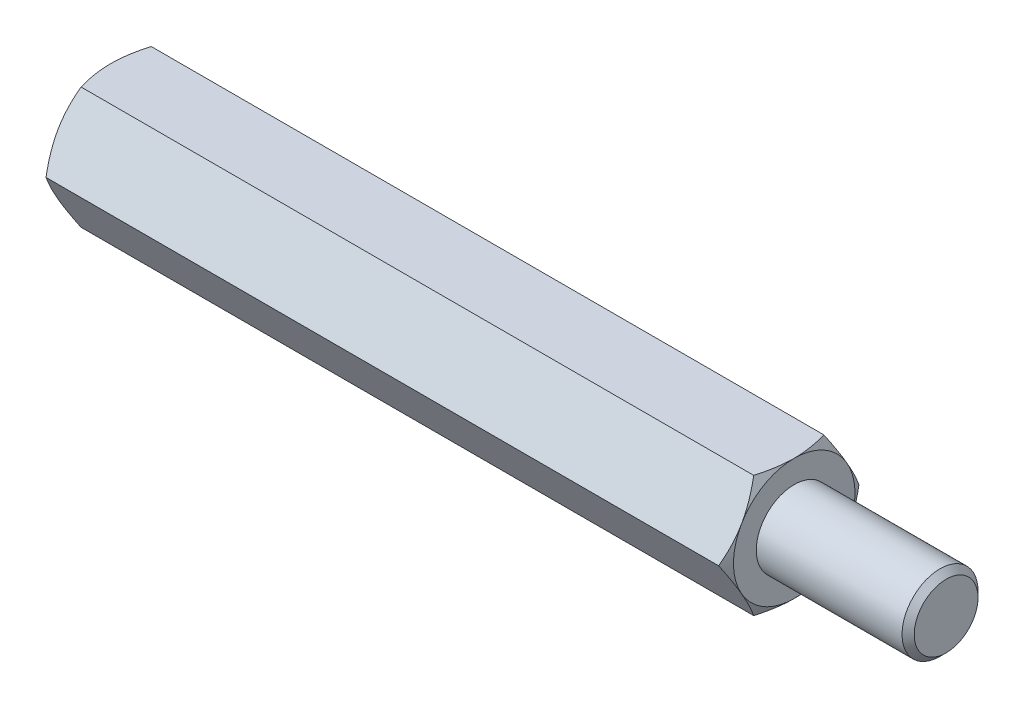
ISO-10303-21;
HEADER;
FILE_DESCRIPTION(('STEP AP214'),'2;1');
FILE_NAME('part.step','',(''),(''),'','','');
FILE_SCHEMA(('AUTOMOTIVE_DESIGN { 1 0 10303 214 1 1 1 1 }'));
ENDSEC;
DATA;
#1=APPLICATION_CONTEXT('core data for automotive mechanical design processes');
#2=APPLICATION_PROTOCOL_DEFINITION('international standard','automotive_design',2000,#1);
#3=PRODUCT_CONTEXT('',#1,'mechanical');
#4=PRODUCT('Part','Part','',(#3));
#5=PRODUCT_RELATED_PRODUCT_CATEGORY('part','',(#4));
#6=PRODUCT_DEFINITION_FORMATION('','',#4);
#7=PRODUCT_DEFINITION_CONTEXT('part definition',#1,'design');
#8=PRODUCT_DEFINITION('design','',#6,#7);
#9=PRODUCT_DEFINITION_SHAPE('','',#8);
#10=(LENGTH_UNIT() NAMED_UNIT(*) SI_UNIT(.MILLI.,.METRE.));
#11=(NAMED_UNIT(*) PLANE_ANGLE_UNIT() SI_UNIT($,.RADIAN.));
#12=(NAMED_UNIT(*) SI_UNIT($,.STERADIAN.) SOLID_ANGLE_UNIT());
#13=UNCERTAINTY_MEASURE_WITH_UNIT(LENGTH_MEASURE(1.E-05),#10,'distance_accuracy_value','');
#14=(GEOMETRIC_REPRESENTATION_CONTEXT(3) GLOBAL_UNCERTAINTY_ASSIGNED_CONTEXT((#13)) GLOBAL_UNIT_ASSIGNED_CONTEXT((#10,
#11,#12)) REPRESENTATION_CONTEXT('',''));
#15=CARTESIAN_POINT('',(0.,0.,0.));
#16=DIRECTION('',(0.,0.,1.));
#17=DIRECTION('',(1.,0.,0.));
#18=AXIS2_PLACEMENT_3D('',#15,#16,#17);
#19=CARTESIAN_POINT('',(22.5,4.,-2.3094010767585));
#20=DIRECTION('',(1.,0.,0.));
#21=DIRECTION('',(0.,0.,-1.));
#22=AXIS2_PLACEMENT_3D('',#19,#20,#21);
#23=PLANE('',#22);
#24=CARTESIAN_POINT('',(22.5,0.,0.));
#25=DIRECTION('',(1.,0.,0.));
#26=DIRECTION('',(0.,0.,-1.));
#27=AXIS2_PLACEMENT_3D('',#24,#25,#26);
#28=CIRCLE('',#27,4.);
#29=CARTESIAN_POINT('',(22.5,-2.,-3.46410161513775));
#30=VERTEX_POINT('',#29);
#31=CARTESIAN_POINT('',(22.5,2.,-3.46410161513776));
#32=VERTEX_POINT('',#31);
#33=EDGE_CURVE('E288',#30,#32,#28,.T.);
#34=ORIENTED_EDGE('',*,*,#33,.T.);
#35=CARTESIAN_POINT('',(22.5,4.,0.));
#36=VERTEX_POINT('',#35);
#37=EDGE_CURVE('E53',#32,#36,#28,.T.);
#38=ORIENTED_EDGE('',*,*,#37,.T.);
#39=CARTESIAN_POINT('',(22.5,2.,3.46410161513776));
#40=VERTEX_POINT('',#39);
#41=EDGE_CURVE('E297',#36,#40,#28,.T.);
#42=ORIENTED_EDGE('',*,*,#41,.T.);
#43=CARTESIAN_POINT('',(22.5,-2.00000000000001,3.46410161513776));
#44=VERTEX_POINT('',#43);
#45=EDGE_CURVE('E301',#40,#44,#28,.T.);
#46=ORIENTED_EDGE('',*,*,#45,.T.);
#47=CARTESIAN_POINT('',(22.5,0.,0.));
#48=DIRECTION('',(-1.,0.,0.));
#49=DIRECTION('',(0.,-1.,0.));
#50=AXIS2_PLACEMENT_3D('',#47,#48,#49);
#51=CIRCLE('',#50,4.);
#52=CARTESIAN_POINT('',(22.5,-4.00000000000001,0.));
#53=VERTEX_POINT('',#52);
#54=EDGE_CURVE('E193',#53,#44,#51,.T.);
#55=ORIENTED_EDGE('',*,*,#54,.F.);
#56=EDGE_CURVE('E61',#53,#30,#28,.T.);
#57=ORIENTED_EDGE('',*,*,#56,.T.);
#58=EDGE_LOOP('',(#34,#38,#42,#46,#55,#57));
#59=FACE_BOUND('',#58,.T.);
#60=CARTESIAN_POINT('',(22.5,0.,0.));
#61=DIRECTION('',(1.,0.,0.));
#62=DIRECTION('',(0.,0.,-1.));
#63=AXIS2_PLACEMENT_3D('',#60,#61,#62);
#64=CIRCLE('',#63,2.5);
#65=CARTESIAN_POINT('',(22.5,0.,-2.5));
#66=VERTEX_POINT('',#65);
#67=EDGE_CURVE('E322',#66,#66,#64,.T.);
#68=ORIENTED_EDGE('',*,*,#67,.F.);
#69=EDGE_LOOP('',(#68));
#70=FACE_BOUND('',#69,.T.);
#71=ADVANCED_FACE('F37',(#59,#70),#23,.T.);
#72=CARTESIAN_POINT('',(22.5,0.,-4.61880215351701));
#73=DIRECTION('',(0.,-0.5,0.866025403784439));
#74=DIRECTION('',(0.,-0.866025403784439,-0.5));
#75=AXIS2_PLACEMENT_3D('',#72,#73,#74);
#76=PLANE('',#75);
#77=CARTESIAN_POINT('',(22.1426677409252,-0.000200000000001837,-4.61891762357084));
#78=CARTESIAN_POINT('',(22.2012821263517,0.175579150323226,-4.51743148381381));
#79=CARTESIAN_POINT('',(22.2545896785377,0.352875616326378,-4.41506932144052));
#80=CARTESIAN_POINT('',(22.3476383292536,0.710538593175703,-4.2085725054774));
#81=CARTESIAN_POINT('',(22.3873465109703,0.890911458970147,-4.10443418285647));
#82=CARTESIAN_POINT('',(22.4491577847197,1.24942181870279,-3.89744813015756));
#83=CARTESIAN_POINT('',(22.4716722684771,1.42750415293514,-3.79463224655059));
#84=CARTESIAN_POINT('',(22.4985493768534,1.7845067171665,-3.58851671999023));
#85=CARTESIAN_POINT('',(22.5029342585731,1.9634256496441,-3.48521782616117));
#86=CARTESIAN_POINT('',(22.49380992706,2.29774284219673,-3.29219970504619));
#87=CARTESIAN_POINT('',(22.482541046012,2.45319115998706,-3.20245157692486));
#88=CARTESIAN_POINT('',(22.4468260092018,2.76307505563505,-3.02354002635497));
#89=CARTESIAN_POINT('',(22.4223676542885,2.91750956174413,-2.93437722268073));
#90=CARTESIAN_POINT('',(22.3612239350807,3.22803232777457,-2.75509682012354));
#91=CARTESIAN_POINT('',(22.3242793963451,3.3840812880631,-2.6650019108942));
#92=CARTESIAN_POINT('',(22.240429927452,3.69385183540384,-2.48615580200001));
#93=CARTESIAN_POINT('',(22.1935446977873,3.84757739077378,-2.39740231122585));
#94=CARTESIAN_POINT('',(22.1426677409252,4.0002,-2.30928560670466));
#95=B_SPLINE_CURVE_WITH_KNOTS('',3,(#77,#78,#79,#80,#81,#82,#83,#84,#85,#86,#87,#88,#89,#90,#91,
#92,#93,#94),.UNSPECIFIED.,.F.,.F.,(4,2,2,2,2,2,2,2,4),(0.,0.634047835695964,1.26961969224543,
1.88946157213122,2.50854226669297,3.04757825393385,3.58711366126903,4.13861653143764,
4.68903648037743),.UNSPECIFIED.);
#96=CARTESIAN_POINT('',(22.1427344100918,0.,-4.61880215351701));
#97=VERTEX_POINT('',#96);
#98=EDGE_CURVE('E330',#97,#32,#95,.T.);
#99=ORIENTED_EDGE('',*,*,#98,.F.);
#100=DIRECTION('',(-1.,0.,0.));
#101=VECTOR('',#100,1.);
#102=CARTESIAN_POINT('',(22.5,0.,-4.61880215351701));
#103=LINE('',#102,#101);
#104=CARTESIAN_POINT('',(-22.1427344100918,0.,-4.61880215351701));
#105=VERTEX_POINT('',#104);
#106=EDGE_CURVE('E264',#97,#105,#103,.T.);
#107=ORIENTED_EDGE('',*,*,#106,.T.);
#108=CARTESIAN_POINT('',(-22.1426677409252,4.0002,-2.30928560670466));
#109=CARTESIAN_POINT('',(-22.2012821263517,3.82442084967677,-2.4107717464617));
#110=CARTESIAN_POINT('',(-22.2545896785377,3.64712438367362,-2.51313390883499));
#111=CARTESIAN_POINT('',(-22.3476383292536,3.28946140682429,-2.71963072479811));
#112=CARTESIAN_POINT('',(-22.3873465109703,3.10908854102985,-2.82376904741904));
#113=CARTESIAN_POINT('',(-22.4491577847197,2.75057818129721,-3.03075510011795));
#114=CARTESIAN_POINT('',(-22.4716722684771,2.57249584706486,-3.13357098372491));
#115=CARTESIAN_POINT('',(-22.4985493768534,2.21549328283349,-3.33968651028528));
#116=CARTESIAN_POINT('',(-22.5029342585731,2.0365743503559,-3.44298540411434));
#117=CARTESIAN_POINT('',(-22.49380992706,1.70225715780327,-3.63600352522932));
#118=CARTESIAN_POINT('',(-22.482541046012,1.54680884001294,-3.72575165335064));
#119=CARTESIAN_POINT('',(-22.4468260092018,1.23692494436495,-3.90466320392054));
#120=CARTESIAN_POINT('',(-22.4223676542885,1.08249043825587,-3.99382600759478));
#121=CARTESIAN_POINT('',(-22.3612239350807,0.771967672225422,-4.17310641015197));
#122=CARTESIAN_POINT('',(-22.3242793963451,0.615918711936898,-4.26320131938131));
#123=CARTESIAN_POINT('',(-22.240429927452,0.30614816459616,-4.4420474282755));
#124=CARTESIAN_POINT('',(-22.1935446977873,0.15242260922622,-4.53080091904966));
#125=CARTESIAN_POINT('',(-22.1426677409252,-0.000200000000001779,-4.61891762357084));
#126=B_SPLINE_CURVE_WITH_KNOTS('',3,(#108,#109,#110,#111,#112,#113,#114,#115,#116,#117,#118,
#119,#120,#121,#122,#123,#124,#125),.UNSPECIFIED.,.F.,.F.,(4,2,2,2,2,2,2,2,4),(0.,
0.634047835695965,1.26961969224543,1.88946157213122,2.50854226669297,3.04757825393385,
3.58711366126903,4.13861653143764,4.68903648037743),.UNSPECIFIED.);
#127=CARTESIAN_POINT('',(-22.5,2.,-3.46410161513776));
#128=VERTEX_POINT('',#127);
#129=EDGE_CURVE('E335',#128,#105,#126,.T.);
#130=ORIENTED_EDGE('',*,*,#129,.F.);
#131=CARTESIAN_POINT('',(-22.1427344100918,4.,-2.3094010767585));
#132=VERTEX_POINT('',#131);
#133=EDGE_CURVE('E332',#132,#128,#126,.T.);
#134=ORIENTED_EDGE('',*,*,#133,.F.);
#135=DIRECTION('',(-1.,0.,0.));
#136=VECTOR('',#135,1.);
#137=CARTESIAN_POINT('',(22.5,4.,-2.3094010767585));
#138=LINE('',#137,#136);
#139=CARTESIAN_POINT('',(22.142734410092,4.,-2.30940107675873));
#140=VERTEX_POINT('',#139);
#141=EDGE_CURVE('E279',#140,#132,#138,.T.);
#142=ORIENTED_EDGE('',*,*,#141,.F.);
#143=EDGE_CURVE('E229',#32,#140,#95,.T.);
#144=ORIENTED_EDGE('',*,*,#143,.F.);
#145=EDGE_LOOP('',(#99,#107,#130,#134,#142,#144));
#146=FACE_BOUND('',#145,.T.);
#147=ADVANCED_FACE('F148',(#146),#76,.F.);
#148=CARTESIAN_POINT('',(22.5,4.,-2.3094010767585));
#149=DIRECTION('',(0.,-1.,0.));
#150=DIRECTION('',(0.,0.,-1.));
#151=AXIS2_PLACEMENT_3D('',#148,#149,#150);
#152=PLANE('',#151);
#153=CARTESIAN_POINT('',(20.5082907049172,4.,-6.28479524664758));
#154=CARTESIAN_POINT('',(20.5937006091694,4.,-6.10939349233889));
#155=CARTESIAN_POINT('',(20.6783148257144,4.,-5.93359774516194));
#156=CARTESIAN_POINT('',(20.8455059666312,4.,-5.58100905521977));
#157=CARTESIAN_POINT('',(20.9280825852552,4.,-5.40421596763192));
#158=CARTESIAN_POINT('',(21.0911508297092,4.,-5.04855089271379));
#159=CARTESIAN_POINT('',(21.1716293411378,4.,-4.86967287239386));
#160=CARTESIAN_POINT('',(21.329400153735,4.,-4.51052237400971));
#161=CARTESIAN_POINT('',(21.406692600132,4.,-4.33024995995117));
#162=CARTESIAN_POINT('',(21.559802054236,4.,-3.96189114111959));
#163=CARTESIAN_POINT('',(21.635480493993,4.,-3.77374683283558));
#164=CARTESIAN_POINT('',(21.7813045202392,4.,-3.39528725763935));
#165=CARTESIAN_POINT('',(21.8514494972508,4.,-3.2049717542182));
#166=CARTESIAN_POINT('',(21.9844245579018,4.,-2.82219775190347));
#167=CARTESIAN_POINT('',(22.0472687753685,4.,-2.62974421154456));
#168=CARTESIAN_POINT('',(22.1636796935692,4.,-2.24207725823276));
#169=CARTESIAN_POINT('',(22.2172492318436,4.,-2.04686470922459));
#170=CARTESIAN_POINT('',(22.3123031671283,4.,-1.65467425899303));
#171=CARTESIAN_POINT('',(22.3538563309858,4.,-1.45771333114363));
#172=CARTESIAN_POINT('',(22.4225903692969,4.,-1.06125849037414));
#173=CARTESIAN_POINT('',(22.4497727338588,4.,-0.861764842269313));
#174=CARTESIAN_POINT('',(22.4872447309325,4.,-0.463879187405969));
#175=CARTESIAN_POINT('',(22.4977578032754,4.,-0.265508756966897));
#176=CARTESIAN_POINT('',(22.5015934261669,4.,0.131417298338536));
#177=CARTESIAN_POINT('',(22.4949158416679,4.,0.329972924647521));
#178=CARTESIAN_POINT('',(22.4696489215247,4.,0.664692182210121));
#179=CARTESIAN_POINT('',(22.4553708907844,4.,0.801202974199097));
#180=CARTESIAN_POINT('',(22.4195349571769,4.,1.07327201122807));
#181=CARTESIAN_POINT('',(22.3979761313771,4.,1.20883013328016));
#182=CARTESIAN_POINT('',(22.3235066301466,4.,1.61386939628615));
#183=CARTESIAN_POINT('',(22.2608149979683,4.,1.88157484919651));
#184=CARTESIAN_POINT('',(22.1515117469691,4.,2.28197262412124));
#185=CARTESIAN_POINT('',(22.112009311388,4.,2.41672443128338));
#186=CARTESIAN_POINT('',(22.0287523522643,4.,2.68492067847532));
#187=CARTESIAN_POINT('',(21.9849977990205,4.,2.81836510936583));
#188=CARTESIAN_POINT('',(21.8939510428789,4.,3.08398596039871));
#189=CARTESIAN_POINT('',(21.846659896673,4.,3.21616274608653));
#190=CARTESIAN_POINT('',(21.7491111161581,4.,3.47941134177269));
#191=CARTESIAN_POINT('',(21.6988535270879,4.,3.61048316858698));
#192=CARTESIAN_POINT('',(21.5713295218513,4.,3.93385125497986));
#193=CARTESIAN_POINT('',(21.4926014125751,4.,4.12557021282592));
#194=CARTESIAN_POINT('',(21.3309693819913,4.,4.50724553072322));
#195=CARTESIAN_POINT('',(21.2480651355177,4.,4.69720175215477));
#196=CARTESIAN_POINT('',(21.0789699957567,4.,5.07569950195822));
#197=CARTESIAN_POINT('',(20.9927782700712,4.,5.26424065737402));
#198=CARTESIAN_POINT('',(20.8178011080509,4.,5.64011758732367));
#199=CARTESIAN_POINT('',(20.7290156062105,4.,5.82745333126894));
#200=CARTESIAN_POINT('',(20.4593432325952,4.,6.38844423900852));
#201=CARTESIAN_POINT('',(20.2753561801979,4.,6.76060781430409));
#202=CARTESIAN_POINT('',(19.9019562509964,4.,7.50211228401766));
#203=CARTESIAN_POINT('',(19.7125442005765,4.,7.87145359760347));
#204=CARTESIAN_POINT('',(19.3473877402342,4.,8.57450173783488));
#205=CARTESIAN_POINT('',(19.171975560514,4.,8.90838144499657));
#206=CARTESIAN_POINT('',(18.8188097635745,4.,9.57491712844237));
#207=CARTESIAN_POINT('',(18.6410560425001,4.,9.90757304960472));
#208=CARTESIAN_POINT('',(18.2842933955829,4.,10.5709822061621));
#209=CARTESIAN_POINT('',(18.1052895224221,3.99999999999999,10.9017381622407));
#210=CARTESIAN_POINT('',(17.7459071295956,3.99999999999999,11.5624752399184));
#211=CARTESIAN_POINT('',(17.5655286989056,3.99999999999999,11.8924564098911));
#212=CARTESIAN_POINT('',(17.384642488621,3.99999999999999,12.2221569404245));
#213=B_SPLINE_CURVE_WITH_KNOTS('',3,(#153,#154,#155,#156,#157,#158,#159,#160,#161,#162,#163,
#164,#165,#166,#167,#168,#169,#170,#171,#172,#173,#174,#175,#176,#177,#178,#179,#180,#181,#182,
#183,#184,#185,#186,#187,#188,#189,#190,#191,#192,#193,#194,#195,#196,#197,#198,#199,#200,#201,
#202,#203,#204,#205,#206,#207,#208,#209,#210,#211,#212),.UNSPECIFIED.,.F.,.F.,(4,2,2,2,2,2,2,2,
2,2,2,2,2,2,2,2,2,2,2,2,2,2,2,2,2,2,2,2,2,4),(0.,0.58528075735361,1.17064881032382,
1.75906864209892,2.34746162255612,2.95577704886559,3.56415938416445,4.17134357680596,
4.77834167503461,5.38179402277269,5.98518378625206,6.58041501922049,7.17565092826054,
7.5872191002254,7.99883946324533,8.82250155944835,9.24373134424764,9.66496407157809,
10.086071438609,10.5071723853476,11.1288656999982,11.7506074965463,12.3725077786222,
12.9944237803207,14.2398211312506,15.4850297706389,16.6164791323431,17.7479788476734,
18.8762380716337,20.0044248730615),.UNSPECIFIED.);
#214=EDGE_CURVE('E227',#140,#36,#213,.T.);
#215=ORIENTED_EDGE('',*,*,#214,.F.);
#216=ORIENTED_EDGE('',*,*,#141,.T.);
#217=CARTESIAN_POINT('',(-20.5082907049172,4.,-6.28479524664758));
#218=CARTESIAN_POINT('',(-20.5937006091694,4.,-6.10939349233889));
#219=CARTESIAN_POINT('',(-20.6783148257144,4.,-5.93359774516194));
#220=CARTESIAN_POINT('',(-20.8455059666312,4.,-5.58100905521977));
#221=CARTESIAN_POINT('',(-20.9280825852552,4.,-5.40421596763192));
#222=CARTESIAN_POINT('',(-21.0911508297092,4.,-5.04855089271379));
#223=CARTESIAN_POINT('',(-21.1716293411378,4.,-4.86967287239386));
#224=CARTESIAN_POINT('',(-21.329400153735,4.,-4.51052237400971));
#225=CARTESIAN_POINT('',(-21.406692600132,4.,-4.33024995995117));
#226=CARTESIAN_POINT('',(-21.559802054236,4.,-3.96189114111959));
#227=CARTESIAN_POINT('',(-21.635480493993,4.,-3.77374683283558));
#228=CARTESIAN_POINT('',(-21.7813045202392,4.,-3.39528725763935));
#229=CARTESIAN_POINT('',(-21.8514494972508,4.,-3.2049717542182));
#230=CARTESIAN_POINT('',(-21.9844245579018,4.,-2.82219775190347));
#231=CARTESIAN_POINT('',(-22.0472687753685,4.,-2.62974421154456));
#232=CARTESIAN_POINT('',(-22.1636796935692,4.,-2.24207725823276));
#233=CARTESIAN_POINT('',(-22.2172492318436,4.,-2.04686470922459));
#234=CARTESIAN_POINT('',(-22.3123031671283,4.,-1.65467425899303));
#235=CARTESIAN_POINT('',(-22.3538563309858,4.,-1.45771333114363));
#236=CARTESIAN_POINT('',(-22.4225903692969,4.,-1.06125849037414));
#237=CARTESIAN_POINT('',(-22.4497727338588,4.,-0.861764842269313));
#238=CARTESIAN_POINT('',(-22.4872447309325,4.,-0.463879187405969));
#239=CARTESIAN_POINT('',(-22.4977578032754,4.,-0.265508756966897));
#240=CARTESIAN_POINT('',(-22.5015934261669,4.,0.131417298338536));
#241=CARTESIAN_POINT('',(-22.4949158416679,4.,0.329972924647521));
#242=CARTESIAN_POINT('',(-22.4696489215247,4.,0.664692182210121));
#243=CARTESIAN_POINT('',(-22.4553708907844,4.,0.801202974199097));
#244=CARTESIAN_POINT('',(-22.4195349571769,4.,1.07327201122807));
#245=CARTESIAN_POINT('',(-22.3979761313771,4.,1.20883013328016));
#246=CARTESIAN_POINT('',(-22.3235066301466,4.,1.61386939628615));
#247=CARTESIAN_POINT('',(-22.2608149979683,4.,1.88157484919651));
#248=CARTESIAN_POINT('',(-22.1515117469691,4.,2.28197262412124));
#249=CARTESIAN_POINT('',(-22.112009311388,4.,2.41672443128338));
#250=CARTESIAN_POINT('',(-22.0287523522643,4.,2.68492067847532));
#251=CARTESIAN_POINT('',(-21.9849977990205,4.,2.81836510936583));
#252=CARTESIAN_POINT('',(-21.8939510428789,4.,3.08398596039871));
#253=CARTESIAN_POINT('',(-21.846659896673,4.,3.21616274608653));
#254=CARTESIAN_POINT('',(-21.7491111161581,4.,3.47941134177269));
#255=CARTESIAN_POINT('',(-21.6988535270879,4.,3.61048316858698));
#256=CARTESIAN_POINT('',(-21.5713295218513,4.,3.93385125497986));
#257=CARTESIAN_POINT('',(-21.4926014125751,4.,4.12557021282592));
#258=CARTESIAN_POINT('',(-21.3309693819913,4.,4.50724553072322));
#259=CARTESIAN_POINT('',(-21.2480651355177,4.,4.69720175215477));
#260=CARTESIAN_POINT('',(-21.0789699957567,4.,5.07569950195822));
#261=CARTESIAN_POINT('',(-20.9927782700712,4.,5.26424065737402));
#262=CARTESIAN_POINT('',(-20.8178011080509,4.,5.64011758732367));
#263=CARTESIAN_POINT('',(-20.7290156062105,4.,5.82745333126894));
#264=CARTESIAN_POINT('',(-20.4593432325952,4.,6.38844423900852));
#265=CARTESIAN_POINT('',(-20.2753561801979,4.,6.76060781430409));
#266=CARTESIAN_POINT('',(-19.9019562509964,4.,7.50211228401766));
#267=CARTESIAN_POINT('',(-19.7125442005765,4.,7.87145359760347));
#268=CARTESIAN_POINT('',(-19.3473877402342,4.,8.57450173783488));
#269=CARTESIAN_POINT('',(-19.171975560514,4.,8.90838144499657));
#270=CARTESIAN_POINT('',(-18.8188097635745,4.,9.57491712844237));
#271=CARTESIAN_POINT('',(-18.6410560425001,4.,9.90757304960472));
#272=CARTESIAN_POINT('',(-18.2842933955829,4.,10.5709822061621));
#273=CARTESIAN_POINT('',(-18.1052895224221,3.99999999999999,10.9017381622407));
#274=CARTESIAN_POINT('',(-17.7459071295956,3.99999999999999,11.5624752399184));
#275=CARTESIAN_POINT('',(-17.5655286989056,3.99999999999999,11.8924564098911));
#276=CARTESIAN_POINT('',(-17.384642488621,3.99999999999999,12.2221569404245));
#277=B_SPLINE_CURVE_WITH_KNOTS('',3,(#217,#218,#219,#220,#221,#222,#223,#224,#225,#226,#227,
#228,#229,#230,#231,#232,#233,#234,#235,#236,#237,#238,#239,#240,#241,#242,#243,#244,#245,#246,
#247,#248,#249,#250,#251,#252,#253,#254,#255,#256,#257,#258,#259,#260,#261,#262,#263,#264,#265,
#266,#267,#268,#269,#270,#271,#272,#273,#274,#275,#276),.UNSPECIFIED.,.F.,.F.,(4,2,2,2,2,2,2,2,
2,2,2,2,2,2,2,2,2,2,2,2,2,2,2,2,2,2,2,2,2,4),(0.,0.58528075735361,1.17064881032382,
1.75906864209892,2.34746162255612,2.95577704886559,3.56415938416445,4.17134357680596,
4.77834167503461,5.38179402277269,5.98518378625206,6.58041501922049,7.17565092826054,
7.5872191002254,7.99883946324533,8.82250155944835,9.24373134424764,9.66496407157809,
10.086071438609,10.5071723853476,11.1288656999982,11.7506074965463,12.3725077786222,
12.9944237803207,14.2398211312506,15.4850297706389,16.6164791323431,17.7479788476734,
18.8762380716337,20.0044248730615),.UNSPECIFIED.);
#278=CARTESIAN_POINT('',(-22.5,4.,0.));
#279=VERTEX_POINT('',#278);
#280=EDGE_CURVE('E241',#279,#132,#277,.F.);
#281=ORIENTED_EDGE('',*,*,#280,.F.);
#282=CARTESIAN_POINT('',(-22.1427344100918,4.,2.3094010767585));
#283=VERTEX_POINT('',#282);
#284=EDGE_CURVE('E249',#283,#279,#277,.F.);
#285=ORIENTED_EDGE('',*,*,#284,.F.);
#286=DIRECTION('',(-1.,0.,0.));
#287=VECTOR('',#286,1.);
#288=CARTESIAN_POINT('',(22.5,4.,2.3094010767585));
#289=LINE('',#288,#287);
#290=CARTESIAN_POINT('',(22.1427344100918,4.,2.3094010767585));
#291=VERTEX_POINT('',#290);
#292=EDGE_CURVE('E276',#291,#283,#289,.T.);
#293=ORIENTED_EDGE('',*,*,#292,.F.);
#294=EDGE_CURVE('E221',#36,#291,#213,.T.);
#295=ORIENTED_EDGE('',*,*,#294,.F.);
#296=EDGE_LOOP('',(#215,#216,#281,#285,#293,#295));
#297=FACE_BOUND('',#296,.T.);
#298=ADVANCED_FACE('F153',(#297),#152,.F.);
#299=CARTESIAN_POINT('',(22.5,4.,2.3094010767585));
#300=DIRECTION('',(0.,-0.5,-0.866025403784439));
#301=DIRECTION('',(0.,0.866025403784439,-0.5));
#302=AXIS2_PLACEMENT_3D('',#299,#300,#301);
#303=PLANE('',#302);
#304=CARTESIAN_POINT('',(22.1426677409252,4.0002,2.30928560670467));
#305=CARTESIAN_POINT('',(22.2012821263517,3.82442084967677,2.4107717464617));
#306=CARTESIAN_POINT('',(22.2545896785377,3.64712438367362,2.51313390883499));
#307=CARTESIAN_POINT('',(22.3476383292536,3.28946140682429,2.71963072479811));
#308=CARTESIAN_POINT('',(22.3873465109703,3.10908854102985,2.82376904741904));
#309=CARTESIAN_POINT('',(22.4491577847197,2.75057818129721,3.03075510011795));
#310=CARTESIAN_POINT('',(22.4716722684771,2.57249584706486,3.13357098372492));
#311=CARTESIAN_POINT('',(22.4985493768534,2.21549328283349,3.33968651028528));
#312=CARTESIAN_POINT('',(22.5029342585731,2.0365743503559,3.44298540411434));
#313=CARTESIAN_POINT('',(22.49380992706,1.70225715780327,3.63600352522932));
#314=CARTESIAN_POINT('',(22.482541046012,1.54680884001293,3.72575165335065));
#315=CARTESIAN_POINT('',(22.4468260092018,1.23692494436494,3.90466320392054));
#316=CARTESIAN_POINT('',(22.4223676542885,1.08249043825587,3.99382600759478));
#317=CARTESIAN_POINT('',(22.3612239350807,0.771967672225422,4.17310641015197));
#318=CARTESIAN_POINT('',(22.3242793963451,0.615918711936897,4.26320131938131));
#319=CARTESIAN_POINT('',(22.240429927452,0.30614816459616,4.4420474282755));
#320=CARTESIAN_POINT('',(22.1935446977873,0.152422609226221,4.53080091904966));
#321=CARTESIAN_POINT('',(22.1426677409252,-0.000199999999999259,4.61891762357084));
#322=B_SPLINE_CURVE_WITH_KNOTS('',3,(#304,#305,#306,#307,#308,#309,#310,#311,#312,#313,#314,
#315,#316,#317,#318,#319,#320,#321),.UNSPECIFIED.,.F.,.F.,(4,2,2,2,2,2,2,2,4),(0.,
0.634047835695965,1.26961969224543,1.88946157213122,2.50854226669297,3.04757825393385,
3.58711366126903,4.13861653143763,4.68903648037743),.UNSPECIFIED.);
#323=EDGE_CURVE('E228',#291,#40,#322,.T.);
#324=ORIENTED_EDGE('',*,*,#323,.F.);
#325=ORIENTED_EDGE('',*,*,#292,.T.);
#326=CARTESIAN_POINT('',(-22.1426677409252,-0.000199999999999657,4.61891762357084));
#327=CARTESIAN_POINT('',(-22.2012821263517,0.175579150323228,4.5174314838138));
#328=CARTESIAN_POINT('',(-22.2545896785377,0.352875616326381,4.41506932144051));
#329=CARTESIAN_POINT('',(-22.3476383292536,0.710538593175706,4.20857250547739));
#330=CARTESIAN_POINT('',(-22.3873465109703,0.89091145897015,4.10443418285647));
#331=CARTESIAN_POINT('',(-22.4491577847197,1.24942181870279,3.89744813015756));
#332=CARTESIAN_POINT('',(-22.4716722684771,1.42750415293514,3.79463224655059));
#333=CARTESIAN_POINT('',(-22.4985493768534,1.78450671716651,3.58851671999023));
#334=CARTESIAN_POINT('',(-22.5029342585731,1.9634256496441,3.48521782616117));
#335=CARTESIAN_POINT('',(-22.49380992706,2.29774284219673,3.29219970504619));
#336=CARTESIAN_POINT('',(-22.482541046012,2.45319115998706,3.20245157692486));
#337=CARTESIAN_POINT('',(-22.4468260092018,2.76307505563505,3.02354002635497));
#338=CARTESIAN_POINT('',(-22.4223676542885,2.91750956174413,2.93437722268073));
#339=CARTESIAN_POINT('',(-22.3612239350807,3.22803232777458,2.75509682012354));
#340=CARTESIAN_POINT('',(-22.3242793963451,3.3840812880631,2.6650019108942));
#341=CARTESIAN_POINT('',(-22.240429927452,3.69385183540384,2.48615580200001));
#342=CARTESIAN_POINT('',(-22.1935446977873,3.84757739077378,2.39740231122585));
#343=CARTESIAN_POINT('',(-22.1426677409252,4.0002,2.30928560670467));
#344=B_SPLINE_CURVE_WITH_KNOTS('',3,(#326,#327,#328,#329,#330,#331,#332,#333,#334,#335,#336,
#337,#338,#339,#340,#341,#342,#343),.UNSPECIFIED.,.F.,.F.,(4,2,2,2,2,2,2,2,4),(0.,
0.634047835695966,1.26961969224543,1.88946157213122,2.50854226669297,3.04757825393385,
3.58711366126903,4.13861653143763,4.68903648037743),.UNSPECIFIED.);
#345=CARTESIAN_POINT('',(-22.5,2.,3.46410161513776));
#346=VERTEX_POINT('',#345);
#347=EDGE_CURVE('E255',#346,#283,#344,.T.);
#348=ORIENTED_EDGE('',*,*,#347,.F.);
#349=CARTESIAN_POINT('',(-22.1427344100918,0.,4.618802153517));
#350=VERTEX_POINT('',#349);
#351=EDGE_CURVE('E262',#350,#346,#344,.T.);
#352=ORIENTED_EDGE('',*,*,#351,.F.);
#353=DIRECTION('',(-1.,0.,0.));
#354=VECTOR('',#353,1.);
#355=CARTESIAN_POINT('',(22.5,0.,4.618802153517));
#356=LINE('',#355,#354);
#357=CARTESIAN_POINT('',(22.1427344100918,0.,4.618802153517));
#358=VERTEX_POINT('',#357);
#359=EDGE_CURVE('E273',#358,#350,#356,.T.);
#360=ORIENTED_EDGE('',*,*,#359,.F.);
#361=EDGE_CURVE('E215',#40,#358,#322,.T.);
#362=ORIENTED_EDGE('',*,*,#361,.F.);
#363=EDGE_LOOP('',(#324,#325,#348,#352,#360,#362));
#364=FACE_BOUND('',#363,.T.);
#365=ADVANCED_FACE('F235',(#364),#303,.F.);
#366=CARTESIAN_POINT('',(22.5,0.,4.618802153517));
#367=DIRECTION('',(0.,0.5,-0.866025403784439));
#368=DIRECTION('',(0.,0.866025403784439,0.5));
#369=AXIS2_PLACEMENT_3D('',#366,#367,#368);
#370=PLANE('',#369);
#371=CARTESIAN_POINT('',(22.1426677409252,0.000200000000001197,4.61891762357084));
#372=CARTESIAN_POINT('',(22.2012821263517,-0.175579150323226,4.5174314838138));
#373=CARTESIAN_POINT('',(22.2545896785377,-0.352875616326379,4.41506932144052));
#374=CARTESIAN_POINT('',(22.3476383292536,-0.710538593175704,4.20857250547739));
#375=CARTESIAN_POINT('',(22.3873465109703,-0.890911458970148,4.10443418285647));
#376=CARTESIAN_POINT('',(22.4491577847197,-1.24942181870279,3.89744813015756));
#377=CARTESIAN_POINT('',(22.4716722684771,-1.42750415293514,3.79463224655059));
#378=CARTESIAN_POINT('',(22.4985493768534,-1.78450671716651,3.58851671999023));
#379=CARTESIAN_POINT('',(22.5029342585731,-1.9634256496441,3.48521782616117));
#380=CARTESIAN_POINT('',(22.49380992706,-2.29774284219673,3.29219970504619));
#381=CARTESIAN_POINT('',(22.482541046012,-2.45319115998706,3.20245157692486));
#382=CARTESIAN_POINT('',(22.4468260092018,-2.76307505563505,3.02354002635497));
#383=CARTESIAN_POINT('',(22.4223676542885,-2.91750956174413,2.93437722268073));
#384=CARTESIAN_POINT('',(22.3612239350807,-3.22803232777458,2.75509682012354));
#385=CARTESIAN_POINT('',(22.3242793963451,-3.3840812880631,2.6650019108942));
#386=CARTESIAN_POINT('',(22.240429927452,-3.69385183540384,2.48615580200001));
#387=CARTESIAN_POINT('',(22.1935446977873,-3.84757739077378,2.39740231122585));
#388=CARTESIAN_POINT('',(22.1426677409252,-4.0002,2.30928560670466));
#389=B_SPLINE_CURVE_WITH_KNOTS('',3,(#371,#372,#373,#374,#375,#376,#377,#378,#379,#380,#381,
#382,#383,#384,#385,#386,#387,#388),.UNSPECIFIED.,.F.,.F.,(4,2,2,2,2,2,2,2,4),(0.,
0.634047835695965,1.26961969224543,1.88946157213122,2.50854226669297,3.04757825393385,
3.58711366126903,4.13861653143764,4.68903648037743),.UNSPECIFIED.);
#390=EDGE_CURVE('E405',#358,#44,#389,.T.);
#391=ORIENTED_EDGE('',*,*,#390,.F.);
#392=ORIENTED_EDGE('',*,*,#359,.T.);
#393=CARTESIAN_POINT('',(-22.1426677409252,-4.0002,2.30928560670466));
#394=CARTESIAN_POINT('',(-22.2012821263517,-3.82442084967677,2.4107717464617));
#395=CARTESIAN_POINT('',(-22.2545896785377,-3.64712438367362,2.51313390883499));
#396=CARTESIAN_POINT('',(-22.3476383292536,-3.2894614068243,2.71963072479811));
#397=CARTESIAN_POINT('',(-22.3873465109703,-3.10908854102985,2.82376904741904));
#398=CARTESIAN_POINT('',(-22.4491577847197,-2.75057818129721,3.03075510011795));
#399=CARTESIAN_POINT('',(-22.4716722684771,-2.57249584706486,3.13357098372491));
#400=CARTESIAN_POINT('',(-22.4985493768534,-2.2154932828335,3.33968651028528));
#401=CARTESIAN_POINT('',(-22.5029342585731,-2.03657435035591,3.44298540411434));
#402=CARTESIAN_POINT('',(-22.49380992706,-1.70225715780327,3.63600352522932));
#403=CARTESIAN_POINT('',(-22.482541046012,-1.54680884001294,3.72575165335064));
#404=CARTESIAN_POINT('',(-22.4468260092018,-1.23692494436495,3.90466320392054));
#405=CARTESIAN_POINT('',(-22.4223676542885,-1.08249043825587,3.99382600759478));
#406=CARTESIAN_POINT('',(-22.3612239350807,-0.771967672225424,4.17310641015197));
#407=CARTESIAN_POINT('',(-22.3242793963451,-0.615918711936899,4.26320131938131));
#408=CARTESIAN_POINT('',(-22.240429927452,-0.306148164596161,4.4420474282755));
#409=CARTESIAN_POINT('',(-22.1935446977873,-0.152422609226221,4.53080091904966));
#410=CARTESIAN_POINT('',(-22.1426677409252,0.000200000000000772,4.61891762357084));
#411=B_SPLINE_CURVE_WITH_KNOTS('',3,(#393,#394,#395,#396,#397,#398,#399,#400,#401,#402,#403,
#404,#405,#406,#407,#408,#409,#410),.UNSPECIFIED.,.F.,.F.,(4,2,2,2,2,2,2,2,4),(0.,
0.634047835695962,1.26961969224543,1.88946157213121,2.50854226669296,3.04757825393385,
3.58711366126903,4.13861653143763,4.68903648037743),.UNSPECIFIED.);
#412=CARTESIAN_POINT('',(-22.5,-2.00000000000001,3.46410161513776));
#413=VERTEX_POINT('',#412);
#414=EDGE_CURVE('E263',#413,#350,#411,.T.);
#415=ORIENTED_EDGE('',*,*,#414,.F.);
#416=CARTESIAN_POINT('',(-22.1427344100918,-4.,2.3094010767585));
#417=VERTEX_POINT('',#416);
#418=EDGE_CURVE('E250',#417,#413,#411,.T.);
#419=ORIENTED_EDGE('',*,*,#418,.F.);
#420=DIRECTION('',(-1.,0.,0.));
#421=VECTOR('',#420,1.);
#422=CARTESIAN_POINT('',(22.5,-4.,2.3094010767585));
#423=LINE('',#422,#421);
#424=CARTESIAN_POINT('',(22.1427344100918,-4.,2.3094010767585));
#425=VERTEX_POINT('',#424);
#426=EDGE_CURVE('E270',#425,#417,#423,.T.);
#427=ORIENTED_EDGE('',*,*,#426,.F.);
#428=EDGE_CURVE('E210',#44,#425,#389,.T.);
#429=ORIENTED_EDGE('',*,*,#428,.F.);
#430=EDGE_LOOP('',(#391,#392,#415,#419,#427,#429));
#431=FACE_BOUND('',#430,.T.);
#432=ADVANCED_FACE('F447',(#431),#370,.F.);
#433=CARTESIAN_POINT('',(22.5,-4.,2.3094010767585));
#434=DIRECTION('',(0.,1.,0.));
#435=DIRECTION('',(0.,0.,1.));
#436=AXIS2_PLACEMENT_3D('',#433,#434,#435);
#437=PLANE('',#436);
#438=CARTESIAN_POINT('',(20.5082907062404,-4.,-6.28479524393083));
#439=CARTESIAN_POINT('',(20.5937006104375,-4.,-6.10939348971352));
#440=CARTESIAN_POINT('',(20.6783148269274,-4.,-5.93359774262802));
#441=CARTESIAN_POINT('',(20.8455059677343,-4.,-5.58100905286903));
#442=CARTESIAN_POINT('',(20.9280825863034,-4.,-5.4042159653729));
#443=CARTESIAN_POINT('',(21.0911508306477,-4.,-5.04855089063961));
#444=CARTESIAN_POINT('',(21.1716293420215,-4.,-4.8696728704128));
#445=CARTESIAN_POINT('',(21.3294001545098,-4.,-4.51052237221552));
#446=CARTESIAN_POINT('',(21.4066926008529,-4.,-4.33024995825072));
#447=CARTESIAN_POINT('',(21.5598020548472,-4.,-3.96189113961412));
#448=CARTESIAN_POINT('',(21.6354804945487,-4.,-3.77374683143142));
#449=CARTESIAN_POINT('',(21.7813045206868,-4.,-3.39528725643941));
#450=CARTESIAN_POINT('',(21.8514494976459,-4.,-3.20497175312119));
#451=CARTESIAN_POINT('',(21.9844245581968,-4.,-2.82219775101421));
#452=CARTESIAN_POINT('',(22.0472687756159,-4.,-2.62974421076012));
#453=CARTESIAN_POINT('',(22.1636796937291,-4.,-2.24207725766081));
#454=CARTESIAN_POINT('',(22.2172492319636,-4.,-2.04686470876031));
#455=CARTESIAN_POINT('',(22.3123031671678,-4.,-1.65467425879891));
#456=CARTESIAN_POINT('',(22.3538563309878,-4.,-1.45771333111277));
#457=CARTESIAN_POINT('',(22.4225903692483,-4.,-1.06125849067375));
#458=CARTESIAN_POINT('',(22.4497727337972,-4.,-0.861764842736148));
#459=CARTESIAN_POINT('',(22.4872447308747,-4.,-0.46387918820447));
#460=CARTESIAN_POINT('',(22.4977578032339,-4.,-0.265508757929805));
#461=CARTESIAN_POINT('',(22.5015934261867,-4.,0.131417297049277));
#462=CARTESIAN_POINT('',(22.4949158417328,-4.,0.329972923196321));
#463=CARTESIAN_POINT('',(22.4696489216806,-4.,0.664692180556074));
#464=CARTESIAN_POINT('',(22.4553708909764,-4.,0.801202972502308));
#465=CARTESIAN_POINT('',(22.4195349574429,-4.,1.07327200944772));
#466=CARTESIAN_POINT('',(22.3979761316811,-4.,1.20883013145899));
#467=CARTESIAN_POINT('',(22.3235066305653,-4.,1.6138693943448));
#468=CARTESIAN_POINT('',(22.2608149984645,-4.,1.88157484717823));
#469=CARTESIAN_POINT('',(22.1515117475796,-4.,2.28197262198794));
#470=CARTESIAN_POINT('',(22.1120093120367,-4.,2.41672442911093));
#471=CARTESIAN_POINT('',(22.0287523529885,-4.,2.68492067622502));
#472=CARTESIAN_POINT('',(21.9849977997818,-4.,2.81836510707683));
#473=CARTESIAN_POINT('',(21.8939510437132,-4.,3.0839859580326));
#474=CARTESIAN_POINT('',(21.8466598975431,-4.,3.21616274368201));
#475=CARTESIAN_POINT('',(21.7491111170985,-4.,3.47941133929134));
#476=CARTESIAN_POINT('',(21.6988535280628,-4.,3.61048316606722));
#477=CARTESIAN_POINT('',(21.5713295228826,-4.,3.93385125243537));
#478=CARTESIAN_POINT('',(21.4926014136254,-4.,4.12557021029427));
#479=CARTESIAN_POINT('',(21.330969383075,-4.,4.50724552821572));
#480=CARTESIAN_POINT('',(21.2480651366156,-4.,4.69720174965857));
#481=CARTESIAN_POINT('',(21.0789699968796,-4.,5.07569949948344));
#482=CARTESIAN_POINT('',(20.9927782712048,-4.,5.26424065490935));
#483=CARTESIAN_POINT('',(20.8178011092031,-4.,5.64011758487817));
#484=CARTESIAN_POINT('',(20.7290156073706,-4.,5.8274533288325));
#485=CARTESIAN_POINT('',(20.4593432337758,-4.,6.38844423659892));
#486=CARTESIAN_POINT('',(20.275356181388,-4.,6.76060781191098));
#487=CARTESIAN_POINT('',(19.9019562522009,-4.,7.50211228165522));
#488=CARTESIAN_POINT('',(19.7125442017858,-4.,7.87145359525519));
#489=CARTESIAN_POINT('',(19.3473877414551,-4.,8.57450173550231));
#490=CARTESIAN_POINT('',(19.171975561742,-4.,8.90838144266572));
#491=CARTESIAN_POINT('',(18.8188097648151,-4.,9.57491712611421));
#492=CARTESIAN_POINT('',(18.6410560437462,-4.,9.90757304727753));
#493=CARTESIAN_POINT('',(18.28429339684,-4.,10.5709822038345));
#494=CARTESIAN_POINT('',(18.1052895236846,-4.,10.9017381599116));
#495=CARTESIAN_POINT('',(17.7459071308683,-4.,11.562475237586));
#496=CARTESIAN_POINT('',(17.565528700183,-4.,11.8924564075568));
#497=CARTESIAN_POINT('',(17.384642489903,-4.,12.2221569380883));
#498=B_SPLINE_CURVE_WITH_KNOTS('',3,(#438,#439,#440,#441,#442,#443,#444,#445,#446,#447,#448,
#449,#450,#451,#452,#453,#454,#455,#456,#457,#458,#459,#460,#461,#462,#463,#464,#465,#466,#467,
#468,#469,#470,#471,#472,#473,#474,#475,#476,#477,#478,#479,#480,#481,#482,#483,#484,#485,#486,
#487,#488,#489,#490,#491,#492,#493,#494,#495,#496,#497),.UNSPECIFIED.,.F.,.F.,(4,2,2,2,2,2,2,2,
2,2,2,2,2,2,2,2,2,2,2,2,2,2,2,2,2,2,2,2,2,4),(0.,0.585280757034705,1.17064880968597,
1.75906864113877,2.34746162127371,2.95577704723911,3.56415938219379,4.17134357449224,
4.77834167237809,5.38179401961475,5.98518378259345,6.58041501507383,7.17565092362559,
7.58721909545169,7.99883945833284,8.82250155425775,9.24373133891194,9.6649640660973,
10.0860714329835,10.5071723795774,11.1288656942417,11.7506074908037,12.3725077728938,
12.9944237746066,14.2398211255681,15.4850297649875,16.6164791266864,17.7479788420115,
18.8762380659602,20.0044248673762),.UNSPECIFIED.);
#499=EDGE_CURVE('E408',#425,#53,#498,.F.);
#500=ORIENTED_EDGE('',*,*,#499,.F.);
#501=ORIENTED_EDGE('',*,*,#426,.T.);
#502=CARTESIAN_POINT('',(-20.5082907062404,-4.,-6.28479524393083));
#503=CARTESIAN_POINT('',(-20.5937006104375,-4.,-6.10939348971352));
#504=CARTESIAN_POINT('',(-20.6783148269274,-4.,-5.93359774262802));
#505=CARTESIAN_POINT('',(-20.8455059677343,-4.,-5.58100905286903));
#506=CARTESIAN_POINT('',(-20.9280825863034,-4.,-5.4042159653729));
#507=CARTESIAN_POINT('',(-21.0911508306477,-4.,-5.04855089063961));
#508=CARTESIAN_POINT('',(-21.1716293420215,-4.,-4.8696728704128));
#509=CARTESIAN_POINT('',(-21.3294001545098,-4.,-4.51052237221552));
#510=CARTESIAN_POINT('',(-21.4066926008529,-4.,-4.33024995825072));
#511=CARTESIAN_POINT('',(-21.5598020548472,-4.,-3.96189113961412));
#512=CARTESIAN_POINT('',(-21.6354804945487,-4.,-3.77374683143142));
#513=CARTESIAN_POINT('',(-21.7813045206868,-4.,-3.39528725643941));
#514=CARTESIAN_POINT('',(-21.8514494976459,-4.,-3.20497175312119));
#515=CARTESIAN_POINT('',(-21.9844245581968,-4.,-2.82219775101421));
#516=CARTESIAN_POINT('',(-22.0472687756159,-4.,-2.62974421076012));
#517=CARTESIAN_POINT('',(-22.1636796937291,-4.,-2.24207725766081));
#518=CARTESIAN_POINT('',(-22.2172492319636,-4.,-2.04686470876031));
#519=CARTESIAN_POINT('',(-22.3123031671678,-4.,-1.65467425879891));
#520=CARTESIAN_POINT('',(-22.3538563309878,-4.,-1.45771333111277));
#521=CARTESIAN_POINT('',(-22.4225903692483,-4.,-1.06125849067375));
#522=CARTESIAN_POINT('',(-22.4497727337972,-4.,-0.861764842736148));
#523=CARTESIAN_POINT('',(-22.4872447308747,-4.,-0.46387918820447));
#524=CARTESIAN_POINT('',(-22.4977578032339,-4.,-0.265508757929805));
#525=CARTESIAN_POINT('',(-22.5015934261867,-4.,0.131417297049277));
#526=CARTESIAN_POINT('',(-22.4949158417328,-4.,0.329972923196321));
#527=CARTESIAN_POINT('',(-22.4696489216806,-4.,0.664692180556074));
#528=CARTESIAN_POINT('',(-22.4553708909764,-4.,0.801202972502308));
#529=CARTESIAN_POINT('',(-22.4195349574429,-4.,1.07327200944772));
#530=CARTESIAN_POINT('',(-22.3979761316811,-4.,1.20883013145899));
#531=CARTESIAN_POINT('',(-22.3235066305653,-4.,1.6138693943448));
#532=CARTESIAN_POINT('',(-22.2608149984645,-4.,1.88157484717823));
#533=CARTESIAN_POINT('',(-22.1515117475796,-4.,2.28197262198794));
#534=CARTESIAN_POINT('',(-22.1120093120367,-4.,2.41672442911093));
#535=CARTESIAN_POINT('',(-22.0287523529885,-4.,2.68492067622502));
#536=CARTESIAN_POINT('',(-21.9849977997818,-4.,2.81836510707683));
#537=CARTESIAN_POINT('',(-21.8939510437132,-4.,3.0839859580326));
#538=CARTESIAN_POINT('',(-21.8466598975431,-4.,3.21616274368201));
#539=CARTESIAN_POINT('',(-21.7491111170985,-4.,3.47941133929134));
#540=CARTESIAN_POINT('',(-21.6988535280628,-4.,3.61048316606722));
#541=CARTESIAN_POINT('',(-21.5713295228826,-4.,3.93385125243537));
#542=CARTESIAN_POINT('',(-21.4926014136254,-4.,4.12557021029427));
#543=CARTESIAN_POINT('',(-21.330969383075,-4.,4.50724552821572));
#544=CARTESIAN_POINT('',(-21.2480651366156,-4.,4.69720174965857));
#545=CARTESIAN_POINT('',(-21.0789699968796,-4.,5.07569949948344));
#546=CARTESIAN_POINT('',(-20.9927782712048,-4.,5.26424065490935));
#547=CARTESIAN_POINT('',(-20.8178011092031,-4.,5.64011758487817));
#548=CARTESIAN_POINT('',(-20.7290156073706,-4.,5.8274533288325));
#549=CARTESIAN_POINT('',(-20.4593432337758,-4.,6.38844423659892));
#550=CARTESIAN_POINT('',(-20.275356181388,-4.,6.76060781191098));
#551=CARTESIAN_POINT('',(-19.9019562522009,-4.,7.50211228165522));
#552=CARTESIAN_POINT('',(-19.7125442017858,-4.,7.87145359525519));
#553=CARTESIAN_POINT('',(-19.3473877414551,-4.,8.57450173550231));
#554=CARTESIAN_POINT('',(-19.171975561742,-4.,8.90838144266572));
#555=CARTESIAN_POINT('',(-18.8188097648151,-4.,9.57491712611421));
#556=CARTESIAN_POINT('',(-18.6410560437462,-4.,9.90757304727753));
#557=CARTESIAN_POINT('',(-18.28429339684,-4.,10.5709822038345));
#558=CARTESIAN_POINT('',(-18.1052895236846,-4.,10.9017381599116));
#559=CARTESIAN_POINT('',(-17.7459071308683,-4.,11.562475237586));
#560=CARTESIAN_POINT('',(-17.565528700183,-4.,11.8924564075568));
#561=CARTESIAN_POINT('',(-17.384642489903,-4.,12.2221569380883));
#562=B_SPLINE_CURVE_WITH_KNOTS('',3,(#502,#503,#504,#505,#506,#507,#508,#509,#510,#511,#512,
#513,#514,#515,#516,#517,#518,#519,#520,#521,#522,#523,#524,#525,#526,#527,#528,#529,#530,#531,
#532,#533,#534,#535,#536,#537,#538,#539,#540,#541,#542,#543,#544,#545,#546,#547,#548,#549,#550,
#551,#552,#553,#554,#555,#556,#557,#558,#559,#560,#561),.UNSPECIFIED.,.F.,.F.,(4,2,2,2,2,2,2,2,
2,2,2,2,2,2,2,2,2,2,2,2,2,2,2,2,2,2,2,2,2,4),(0.,0.585280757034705,1.17064880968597,
1.75906864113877,2.34746162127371,2.95577704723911,3.56415938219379,4.17134357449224,
4.77834167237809,5.38179401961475,5.98518378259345,6.58041501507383,7.17565092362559,
7.58721909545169,7.99883945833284,8.82250155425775,9.24373133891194,9.6649640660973,
10.0860714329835,10.5071723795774,11.1288656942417,11.7506074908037,12.3725077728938,
12.9944237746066,14.2398211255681,15.4850297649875,16.6164791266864,17.7479788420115,
18.8762380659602,20.0044248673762),.UNSPECIFIED.);
#563=CARTESIAN_POINT('',(-22.5,-4.00000000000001,0.));
#564=VERTEX_POINT('',#563);
#565=EDGE_CURVE('E334',#564,#417,#562,.T.);
#566=ORIENTED_EDGE('',*,*,#565,.F.);
#567=CARTESIAN_POINT('',(-22.1427344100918,-4.,-2.3094010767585));
#568=VERTEX_POINT('',#567);
#569=EDGE_CURVE('E338',#568,#564,#562,.T.);
#570=ORIENTED_EDGE('',*,*,#569,.F.);
#571=DIRECTION('',(-1.,0.,0.));
#572=VECTOR('',#571,1.);
#573=CARTESIAN_POINT('',(22.5,-4.,-2.3094010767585));
#574=LINE('',#573,#572);
#575=CARTESIAN_POINT('',(22.1427344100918,-4.,-2.3094010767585));
#576=VERTEX_POINT('',#575);
#577=EDGE_CURVE('E267',#576,#568,#574,.T.);
#578=ORIENTED_EDGE('',*,*,#577,.F.);
#579=EDGE_CURVE('E195',#53,#576,#498,.F.);
#580=ORIENTED_EDGE('',*,*,#579,.F.);
#581=EDGE_LOOP('',(#500,#501,#566,#570,#578,#580));
#582=FACE_BOUND('',#581,.T.);
#583=ADVANCED_FACE('F172',(#582),#437,.F.);
#584=CARTESIAN_POINT('',(22.5,-4.,-2.3094010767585));
#585=DIRECTION('',(0.,0.5,0.866025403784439));
#586=DIRECTION('',(0.,-0.866025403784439,0.5));
#587=AXIS2_PLACEMENT_3D('',#584,#585,#586);
#588=PLANE('',#587);
#589=CARTESIAN_POINT('',(22.1426677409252,-4.0002,-2.30928560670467));
#590=CARTESIAN_POINT('',(22.2012821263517,-3.82442084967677,-2.41077174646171));
#591=CARTESIAN_POINT('',(22.2545896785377,-3.64712438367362,-2.51313390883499));
#592=CARTESIAN_POINT('',(22.3476383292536,-3.2894614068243,-2.71963072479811));
#593=CARTESIAN_POINT('',(22.3873465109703,-3.10908854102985,-2.82376904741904));
#594=CARTESIAN_POINT('',(22.4491577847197,-2.75057818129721,-3.03075510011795));
#595=CARTESIAN_POINT('',(22.4716722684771,-2.57249584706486,-3.13357098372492));
#596=CARTESIAN_POINT('',(22.4985493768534,-2.2154932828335,-3.33968651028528));
#597=CARTESIAN_POINT('',(22.5029342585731,-2.0365743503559,-3.44298540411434));
#598=CARTESIAN_POINT('',(22.49380992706,-1.70225715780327,-3.63600352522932));
#599=CARTESIAN_POINT('',(22.482541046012,-1.54680884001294,-3.72575165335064));
#600=CARTESIAN_POINT('',(22.4468260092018,-1.23692494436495,-3.90466320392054));
#601=CARTESIAN_POINT('',(22.4223676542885,-1.08249043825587,-3.99382600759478));
#602=CARTESIAN_POINT('',(22.3612239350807,-0.771967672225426,-4.17310641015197));
#603=CARTESIAN_POINT('',(22.3242793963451,-0.615918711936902,-4.26320131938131));
#604=CARTESIAN_POINT('',(22.240429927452,-0.306148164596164,-4.4420474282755));
#605=CARTESIAN_POINT('',(22.1935446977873,-0.152422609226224,-4.53080091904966));
#606=CARTESIAN_POINT('',(22.1426677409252,0.000199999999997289,-4.61891762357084));
#607=B_SPLINE_CURVE_WITH_KNOTS('',3,(#589,#590,#591,#592,#593,#594,#595,#596,#597,#598,#599,
#600,#601,#602,#603,#604,#605,#606),.UNSPECIFIED.,.F.,.F.,(4,2,2,2,2,2,2,2,4),(0.,
0.634047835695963,1.26961969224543,1.88946157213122,2.50854226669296,3.04757825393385,
3.58711366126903,4.13861653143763,4.68903648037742),.UNSPECIFIED.);
#608=EDGE_CURVE('E192',#576,#30,#607,.T.);
#609=ORIENTED_EDGE('',*,*,#608,.F.);
#610=ORIENTED_EDGE('',*,*,#577,.T.);
#611=CARTESIAN_POINT('',(-22.1426677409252,0.000199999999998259,-4.61891762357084));
#612=CARTESIAN_POINT('',(-22.2012821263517,-0.17557915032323,-4.5174314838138));
#613=CARTESIAN_POINT('',(-22.2545896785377,-0.352875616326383,-4.41506932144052));
#614=CARTESIAN_POINT('',(-22.3476383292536,-0.710538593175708,-4.2085725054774));
#615=CARTESIAN_POINT('',(-22.3873465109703,-0.890911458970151,-4.10443418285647));
#616=CARTESIAN_POINT('',(-22.4491577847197,-1.24942181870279,-3.89744813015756));
#617=CARTESIAN_POINT('',(-22.4716722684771,-1.42750415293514,-3.79463224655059));
#618=CARTESIAN_POINT('',(-22.4985493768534,-1.78450671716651,-3.58851671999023));
#619=CARTESIAN_POINT('',(-22.5029342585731,-1.9634256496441,-3.48521782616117));
#620=CARTESIAN_POINT('',(-22.49380992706,-2.29774284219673,-3.29219970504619));
#621=CARTESIAN_POINT('',(-22.482541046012,-2.45319115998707,-3.20245157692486));
#622=CARTESIAN_POINT('',(-22.4468260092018,-2.76307505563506,-3.02354002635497));
#623=CARTESIAN_POINT('',(-22.4223676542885,-2.91750956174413,-2.93437722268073));
#624=CARTESIAN_POINT('',(-22.3612239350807,-3.22803232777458,-2.75509682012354));
#625=CARTESIAN_POINT('',(-22.3242793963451,-3.3840812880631,-2.6650019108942));
#626=CARTESIAN_POINT('',(-22.240429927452,-3.69385183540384,-2.48615580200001));
#627=CARTESIAN_POINT('',(-22.1935446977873,-3.84757739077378,-2.39740231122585));
#628=CARTESIAN_POINT('',(-22.1426677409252,-4.0002,-2.30928560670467));
#629=B_SPLINE_CURVE_WITH_KNOTS('',3,(#611,#612,#613,#614,#615,#616,#617,#618,#619,#620,#621,
#622,#623,#624,#625,#626,#627,#628),.UNSPECIFIED.,.F.,.F.,(4,2,2,2,2,2,2,2,4),(0.,
0.634047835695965,1.26961969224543,1.88946157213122,2.50854226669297,3.04757825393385,
3.58711366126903,4.13861653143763,4.68903648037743),.UNSPECIFIED.);
#630=CARTESIAN_POINT('',(-22.5,-2.,-3.46410161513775));
#631=VERTEX_POINT('',#630);
#632=EDGE_CURVE('E178',#631,#568,#629,.T.);
#633=ORIENTED_EDGE('',*,*,#632,.F.);
#634=EDGE_CURVE('E339',#105,#631,#629,.T.);
#635=ORIENTED_EDGE('',*,*,#634,.F.);
#636=ORIENTED_EDGE('',*,*,#106,.F.);
#637=EDGE_CURVE('E185',#30,#97,#607,.T.);
#638=ORIENTED_EDGE('',*,*,#637,.F.);
#639=EDGE_LOOP('',(#609,#610,#633,#635,#636,#638));
#640=FACE_BOUND('',#639,.T.);
#641=ADVANCED_FACE('F167',(#640),#588,.F.);
#642=CARTESIAN_POINT('',(-22.5,0.,0.));
#643=DIRECTION('',(1.,0.,0.));
#644=DIRECTION('',(0.,1.,0.));
#645=AXIS2_PLACEMENT_3D('',#642,#643,#644);
#646=CONICAL_SURFACE('',#645,4.,1.04719755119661);
#647=ORIENTED_EDGE('',*,*,#129,.T.);
#648=ORIENTED_EDGE('',*,*,#634,.T.);
#649=CARTESIAN_POINT('',(-22.5,0.,0.));
#650=DIRECTION('',(1.,0.,0.));
#651=DIRECTION('',(0.,0.,-1.));
#652=AXIS2_PLACEMENT_3D('',#649,#650,#651);
#653=CIRCLE('',#652,4.);
#654=EDGE_CURVE('E282',#631,#128,#653,.T.);
#655=ORIENTED_EDGE('',*,*,#654,.T.);
#656=EDGE_LOOP('',(#647,#648,#655));
#657=FACE_BOUND('',#656,.T.);
#658=ADVANCED_FACE('F171',(#657),#646,.T.);
#659=ORIENTED_EDGE('',*,*,#569,.T.);
#660=EDGE_CURVE('E286',#564,#631,#653,.T.);
#661=ORIENTED_EDGE('',*,*,#660,.T.);
#662=ORIENTED_EDGE('',*,*,#632,.T.);
#663=EDGE_LOOP('',(#659,#661,#662));
#664=FACE_BOUND('',#663,.T.);
#665=ADVANCED_FACE('F418',(#664),#646,.T.);
#666=ORIENTED_EDGE('',*,*,#418,.T.);
#667=CARTESIAN_POINT('',(-22.5,0.,0.));
#668=DIRECTION('',(-1.,0.,0.));
#669=DIRECTION('',(0.,-1.,0.));
#670=AXIS2_PLACEMENT_3D('',#667,#668,#669);
#671=CIRCLE('',#670,4.);
#672=EDGE_CURVE('E381',#564,#413,#671,.T.);
#673=ORIENTED_EDGE('',*,*,#672,.F.);
#674=ORIENTED_EDGE('',*,*,#565,.T.);
#675=EDGE_LOOP('',(#666,#673,#674));
#676=FACE_BOUND('',#675,.T.);
#677=ADVANCED_FACE('F419',(#676),#646,.T.);
#678=ORIENTED_EDGE('',*,*,#351,.T.);
#679=EDGE_CURVE('E420',#346,#413,#653,.T.);
#680=ORIENTED_EDGE('',*,*,#679,.T.);
#681=ORIENTED_EDGE('',*,*,#414,.T.);
#682=EDGE_LOOP('',(#678,#680,#681));
#683=FACE_BOUND('',#682,.T.);
#684=ADVANCED_FACE('F158',(#683),#646,.T.);
#685=ORIENTED_EDGE('',*,*,#347,.T.);
#686=ORIENTED_EDGE('',*,*,#284,.T.);
#687=EDGE_CURVE('E421',#279,#346,#653,.T.);
#688=ORIENTED_EDGE('',*,*,#687,.T.);
#689=EDGE_LOOP('',(#685,#686,#688));
#690=FACE_BOUND('',#689,.T.);
#691=ADVANCED_FACE('F424',(#690),#646,.T.);
#692=ORIENTED_EDGE('',*,*,#280,.T.);
#693=ORIENTED_EDGE('',*,*,#133,.T.);
#694=EDGE_CURVE('E287',#128,#279,#653,.T.);
#695=ORIENTED_EDGE('',*,*,#694,.T.);
#696=EDGE_LOOP('',(#692,#693,#695));
#697=FACE_BOUND('',#696,.T.);
#698=ADVANCED_FACE('F165',(#697),#646,.T.);
#699=CARTESIAN_POINT('',(-22.5,4.,-2.3094010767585));
#700=DIRECTION('',(1.,0.,0.));
#701=DIRECTION('',(0.,0.,-1.));
#702=AXIS2_PLACEMENT_3D('',#699,#700,#701);
#703=PLANE('',#702);
#704=CARTESIAN_POINT('',(-22.5,0.,0.));
#705=DIRECTION('',(-1.,0.,0.));
#706=DIRECTION('',(0.,0.,1.));
#707=AXIS2_PLACEMENT_3D('',#704,#705,#706);
#708=CIRCLE('',#707,2.1);
#709=CARTESIAN_POINT('',(-22.5,0.,2.1));
#710=VERTEX_POINT('',#709);
#711=EDGE_CURVE('E312',#710,#710,#708,.T.);
#712=ORIENTED_EDGE('',*,*,#711,.F.);
#713=EDGE_LOOP('',(#712));
#714=FACE_BOUND('',#713,.T.);
#715=ORIENTED_EDGE('',*,*,#694,.F.);
#716=ORIENTED_EDGE('',*,*,#654,.F.);
#717=ORIENTED_EDGE('',*,*,#660,.F.);
#718=ORIENTED_EDGE('',*,*,#672,.T.);
#719=ORIENTED_EDGE('',*,*,#679,.F.);
#720=ORIENTED_EDGE('',*,*,#687,.F.);
#721=EDGE_LOOP('',(#715,#716,#717,#718,#719,#720));
#722=FACE_BOUND('',#721,.T.);
#723=ADVANCED_FACE('F161',(#714,#722),#703,.F.);
#724=CARTESIAN_POINT('',(22.5,0.,0.));
#725=DIRECTION('',(-1.,0.,0.));
#726=DIRECTION('',(0.,1.,0.));
#727=AXIS2_PLACEMENT_3D('',#724,#725,#726);
#728=CONICAL_SURFACE('',#727,4.,1.04719755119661);
#729=ORIENTED_EDGE('',*,*,#98,.T.);
#730=ORIENTED_EDGE('',*,*,#33,.F.);
#731=ORIENTED_EDGE('',*,*,#637,.T.);
#732=EDGE_LOOP('',(#729,#730,#731));
#733=FACE_BOUND('',#732,.T.);
#734=ADVANCED_FACE('F164',(#733),#728,.T.);
#735=ORIENTED_EDGE('',*,*,#579,.T.);
#736=ORIENTED_EDGE('',*,*,#608,.T.);
#737=ORIENTED_EDGE('',*,*,#56,.F.);
#738=EDGE_LOOP('',(#735,#736,#737));
#739=FACE_BOUND('',#738,.T.);
#740=ADVANCED_FACE('F202',(#739),#728,.T.);
#741=ORIENTED_EDGE('',*,*,#428,.T.);
#742=ORIENTED_EDGE('',*,*,#499,.T.);
#743=ORIENTED_EDGE('',*,*,#54,.T.);
#744=EDGE_LOOP('',(#741,#742,#743));
#745=FACE_BOUND('',#744,.T.);
#746=ADVANCED_FACE('F524',(#745),#728,.T.);
#747=ORIENTED_EDGE('',*,*,#361,.T.);
#748=ORIENTED_EDGE('',*,*,#390,.T.);
#749=ORIENTED_EDGE('',*,*,#45,.F.);
#750=EDGE_LOOP('',(#747,#748,#749));
#751=FACE_BOUND('',#750,.T.);
#752=ADVANCED_FACE('F517',(#751),#728,.T.);
#753=ORIENTED_EDGE('',*,*,#294,.T.);
#754=ORIENTED_EDGE('',*,*,#323,.T.);
#755=ORIENTED_EDGE('',*,*,#41,.F.);
#756=EDGE_LOOP('',(#753,#754,#755));
#757=FACE_BOUND('',#756,.T.);
#758=ADVANCED_FACE('F399',(#757),#728,.T.);
#759=ORIENTED_EDGE('',*,*,#143,.T.);
#760=ORIENTED_EDGE('',*,*,#214,.T.);
#761=ORIENTED_EDGE('',*,*,#37,.F.);
#762=EDGE_LOOP('',(#759,#760,#761));
#763=FACE_BOUND('',#762,.T.);
#764=ADVANCED_FACE('F143',(#763),#728,.T.);
#765=CARTESIAN_POINT('',(-12.5,0.,0.));
#766=DIRECTION('',(-1.,0.,0.));
#767=DIRECTION('',(0.,0.,1.));
#768=AXIS2_PLACEMENT_3D('',#765,#766,#767);
#769=CYLINDRICAL_SURFACE('',#768,2.1);
#770=CARTESIAN_POINT('',(-12.5,0.,0.));
#771=DIRECTION('',(1.,0.,0.));
#772=DIRECTION('',(0.,0.,-1.));
#773=AXIS2_PLACEMENT_3D('',#770,#771,#772);
#774=CIRCLE('',#773,2.1);
#775=CARTESIAN_POINT('',(-12.5,0.,-2.1));
#776=VERTEX_POINT('',#775);
#777=EDGE_CURVE('E316',#776,#776,#774,.T.);
#778=ORIENTED_EDGE('',*,*,#777,.T.);
#779=EDGE_LOOP('',(#778));
#780=FACE_BOUND('',#779,.T.);
#781=ORIENTED_EDGE('',*,*,#711,.T.);
#782=EDGE_LOOP('',(#781));
#783=FACE_BOUND('',#782,.T.);
#784=ADVANCED_FACE('F133',(#780,#783),#769,.F.);
#785=CARTESIAN_POINT('',(-11.2875644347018,0.,0.));
#786=DIRECTION('',(-1.,0.,0.));
#787=DIRECTION('',(0.,0.,1.));
#788=AXIS2_PLACEMENT_3D('',#785,#786,#787);
#789=CONICAL_SURFACE('',#788,0.,1.0471975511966);
#790=ORIENTED_EDGE('',*,*,#777,.F.);
#791=EDGE_LOOP('',(#790));
#792=FACE_BOUND('',#791,.T.);
#793=CARTESIAN_POINT('',(-11.2875644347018,0.,0.));
#794=VERTEX_POINT('',#793);
#795=VERTEX_LOOP('',#794);
#796=FACE_BOUND('',#795,.T.);
#797=ADVANCED_FACE('F130',(#792,#796),#789,.F.);
#798=CARTESIAN_POINT('',(32.5,0.,0.));
#799=DIRECTION('',(-1.,0.,0.));
#800=DIRECTION('',(0.,0.,1.));
#801=AXIS2_PLACEMENT_3D('',#798,#799,#800);
#802=CYLINDRICAL_SURFACE('',#801,2.5);
#803=CARTESIAN_POINT('',(32.1,0.,0.));
#804=DIRECTION('',(1.,0.,0.));
#805=DIRECTION('',(0.,0.,-1.));
#806=AXIS2_PLACEMENT_3D('',#803,#804,#805);
#807=CIRCLE('',#806,2.5);
#808=CARTESIAN_POINT('',(32.1,0.,-2.5));
#809=VERTEX_POINT('',#808);
#810=EDGE_CURVE('E11',#809,#809,#807,.F.);
#811=ORIENTED_EDGE('',*,*,#810,.T.);
#812=EDGE_LOOP('',(#811));
#813=FACE_BOUND('',#812,.T.);
#814=ORIENTED_EDGE('',*,*,#67,.T.);
#815=EDGE_LOOP('',(#814));
#816=FACE_BOUND('',#815,.T.);
#817=ADVANCED_FACE('F132',(#813,#816),#802,.T.);
#818=CARTESIAN_POINT('',(32.5,0.,0.));
#819=DIRECTION('',(1.,0.,0.));
#820=DIRECTION('',(0.,0.,-1.));
#821=AXIS2_PLACEMENT_3D('',#818,#819,#820);
#822=PLANE('',#821);
#823=CARTESIAN_POINT('',(32.5,0.,0.));
#824=DIRECTION('',(1.,0.,0.));
#825=DIRECTION('',(0.,0.,-1.));
#826=AXIS2_PLACEMENT_3D('',#823,#824,#825);
#827=CIRCLE('',#826,2.1);
#828=CARTESIAN_POINT('',(32.5,0.,-2.1));
#829=VERTEX_POINT('',#828);
#830=EDGE_CURVE('E46',#829,#829,#827,.T.);
#831=ORIENTED_EDGE('',*,*,#830,.T.);
#832=EDGE_LOOP('',(#831));
#833=FACE_BOUND('',#832,.T.);
#834=ADVANCED_FACE('F140',(#833),#822,.T.);
#835=CARTESIAN_POINT('',(32.5,0.,0.));
#836=DIRECTION('',(-1.,0.,0.));
#837=DIRECTION('',(0.,0.,1.));
#838=AXIS2_PLACEMENT_3D('',#835,#836,#837);
#839=CONICAL_SURFACE('',#838,2.1,0.785398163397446);
#840=ORIENTED_EDGE('',*,*,#810,.F.);
#841=EDGE_LOOP('',(#840));
#842=FACE_BOUND('',#841,.T.);
#843=ORIENTED_EDGE('',*,*,#830,.F.);
#844=EDGE_LOOP('',(#843));
#845=FACE_BOUND('',#844,.T.);
#846=ADVANCED_FACE('F39',(#842,#845),#839,.T.);
#847=CLOSED_SHELL('',(#71,#147,#298,#365,#432,#583,#641,#658,#665,#677,#684,#691,#698,#723,#734,
#740,#746,#752,#758,#764,#784,#797,#817,#834,#846));
#848=MANIFOLD_SOLID_BREP('B2',#847);
#849=ADVANCED_BREP_SHAPE_REPRESENTATION('',(#18,#848),#14);
#850=SHAPE_DEFINITION_REPRESENTATION(#9,#849);
ENDSEC;
END-ISO-10303-21;
